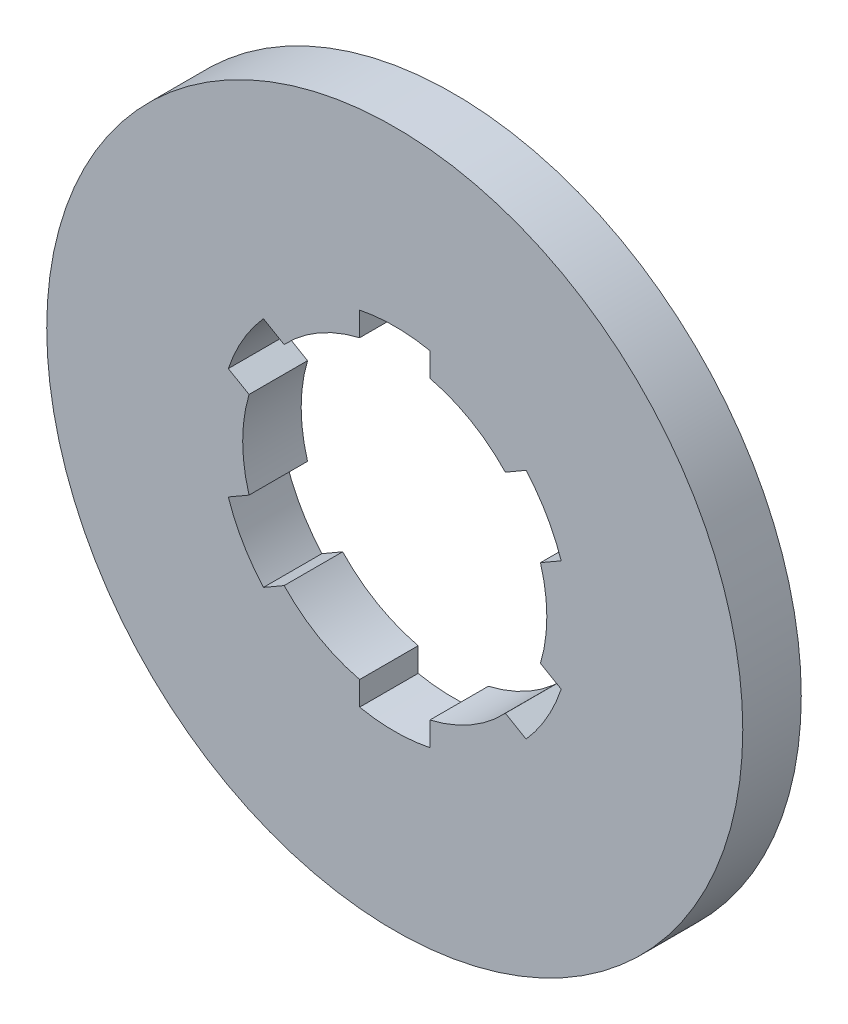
from build123d import *

# Parameters (mm, degrees)
ESQUISSE1_R                  = 29.75
BASE_EXTRUSION_DEPTH         = 2.5
ESQUISSE3_R                  = 13
ENL_V_MAT_EXTRU_1_DEPTH      = 43.368915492
ENL_V_MAT_EXTRU_2_DEPTH      = 58.793256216
R_P_TITION_CIRCULAIRE1_COUNT = 6


with BuildPart() as part:
    # Esquisse1 → Base-Extrusion (new, symmetric)
    with BuildSketch(Plane.XY):
        Circle(ESQUISSE1_R)
    extrude(amount=BASE_EXTRUSION_DEPTH, both=True)

    # Esquisse3 → Enl_v. mat.-Extru.1 (cut, through all)
    with BuildSketch(Plane.XY.offset(2.5)):
        Circle(ESQUISSE3_R)
    extrude(amount=-ENL_V_MAT_EXTRU_1_DEPTH, mode=Mode.SUBTRACT)

    # Esquisse2 → Enl_v. mat.-Extru.2 (cut, through all)
    with BuildSketch(Plane(origin=(-14.376705, -7.235056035, 2.5), x_dir=(1, 0, 0), z_dir=(0, 0, 1))):
        with BuildLine():
            Line((11.376705, 21.931994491), (11.376705, 19.884166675))
            ThreePointArc((11.376705, 19.884166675), (14.376705, 20.235056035), (17.376705, 19.884166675))
            Line((17.376705, 19.884166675), (17.376705, 21.931994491))
            ThreePointArc((17.376705, 21.931994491), (14.376705, 22.235056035), (11.376705, 21.931994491))
        make_face()
    enl_v_mat_extru_2 = extrude(amount=-ENL_V_MAT_EXTRU_2_DEPTH, mode=Mode.SUBTRACT)

    # R_p_tition circulaire1: Enl_v. mat.-Extru.2 ×6 about axis
    r_p_tition_circulaire1_axis = Axis((0, 0, 0), (0, 0, 1))
    for i in range(1, R_P_TITION_CIRCULAIRE1_COUNT):
        add(enl_v_mat_extru_2.rotate(r_p_tition_circulaire1_axis, i * 360 / R_P_TITION_CIRCULAIRE1_COUNT), mode=Mode.SUBTRACT)


solid = part.part
